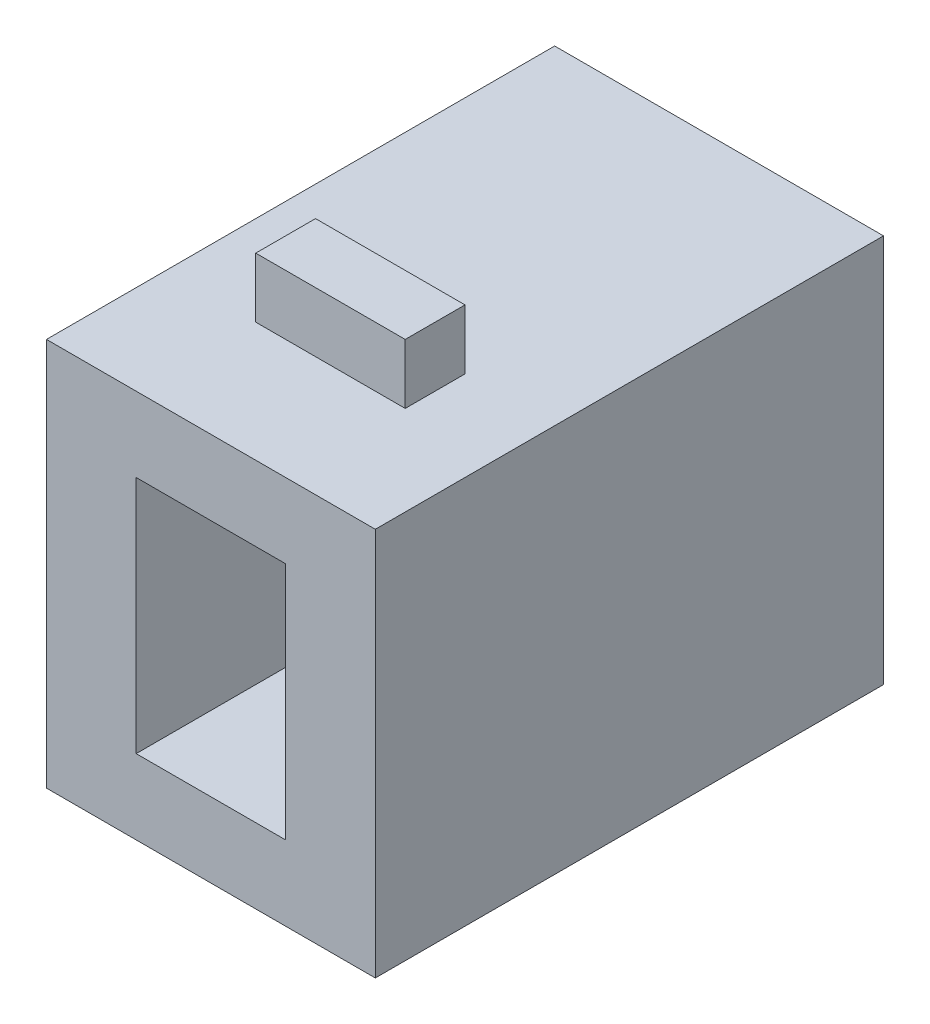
from build123d import *

# Parameters (mm, degrees)
BASE_EXTRUSION_DEPTH      = 15
BASE_EXTRUSION_DEPTH_BACK = 2
ESQUISSE1_W               = 11
ESQUISSE1_H               = 13
ESQUISSE2_W               = 5
ESQUISSE2_H               = 8
ENL_V_MAT_EXTRU_1_DEPTH   = 15
ESQUISSE3_W               = 5
ESQUISSE3_H               = 2
BOSS_EXTRU_1_DEPTH        = 2
ESQUISSE4_W               = 5
ESQUISSE4_H               = 2
BOSS_EXTRU_2_DEPTH        = 2


with BuildPart() as part:
    # Esquisse1 → Base-Extrusion (new, two sides: drawn at the far end of the back side and taken through both)
    with BuildSketch(Plane.XY.offset(-BASE_EXTRUSION_DEPTH_BACK)):
        Rectangle(ESQUISSE1_W, ESQUISSE1_H)
    extrude(amount=BASE_EXTRUSION_DEPTH + BASE_EXTRUSION_DEPTH_BACK)

    # Esquisse2 → Enl_v. mat.-Extru.1 (cut)
    with BuildSketch(Plane.XY.offset(15)):
        Rectangle(ESQUISSE2_W, ESQUISSE2_H)
    extrude(amount=-ENL_V_MAT_EXTRU_1_DEPTH, mode=Mode.SUBTRACT)

    # Esquisse3 → Boss.-Extru.1 (add)
    with BuildSketch(Plane(origin=(0, 6.5, 0), x_dir=(-1, 0, 0), z_dir=(0, 1, 0))):
        with Locations((0, 10)):
            Rectangle(ESQUISSE3_W, ESQUISSE3_H)
    extrude(amount=BOSS_EXTRU_1_DEPTH)

    # Esquisse4 → Boss.-Extru.2 (add)
    with BuildSketch(Plane.XZ.offset(6.5)):
        with Locations((0, 10)):
            Rectangle(ESQUISSE4_W, ESQUISSE4_H)
    extrude(amount=BOSS_EXTRU_2_DEPTH)


solid = part.part
